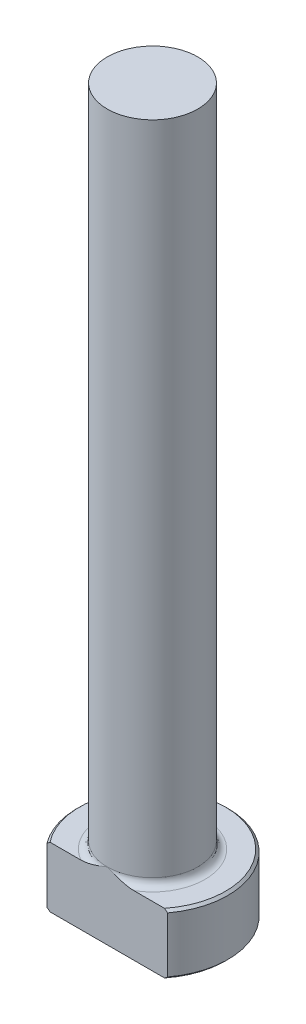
ISO-10303-21;
HEADER;
FILE_DESCRIPTION(('STEP AP214'),'2;1');
FILE_NAME('part.step','',(''),(''),'','','');
FILE_SCHEMA(('AUTOMOTIVE_DESIGN { 1 0 10303 214 1 1 1 1 }'));
ENDSEC;
DATA;
#1=APPLICATION_CONTEXT('core data for automotive mechanical design processes');
#2=APPLICATION_PROTOCOL_DEFINITION('international standard','automotive_design',2000,#1);
#3=PRODUCT_CONTEXT('',#1,'mechanical');
#4=PRODUCT('Part','Part','',(#3));
#5=PRODUCT_RELATED_PRODUCT_CATEGORY('part','',(#4));
#6=PRODUCT_DEFINITION_FORMATION('','',#4);
#7=PRODUCT_DEFINITION_CONTEXT('part definition',#1,'design');
#8=PRODUCT_DEFINITION('design','',#6,#7);
#9=PRODUCT_DEFINITION_SHAPE('','',#8);
#10=(LENGTH_UNIT() NAMED_UNIT(*) SI_UNIT(.MILLI.,.METRE.));
#11=(NAMED_UNIT(*) PLANE_ANGLE_UNIT() SI_UNIT($,.RADIAN.));
#12=(NAMED_UNIT(*) SI_UNIT($,.STERADIAN.) SOLID_ANGLE_UNIT());
#13=UNCERTAINTY_MEASURE_WITH_UNIT(LENGTH_MEASURE(1.E-05),#10,'distance_accuracy_value','');
#14=(GEOMETRIC_REPRESENTATION_CONTEXT(3) GLOBAL_UNCERTAINTY_ASSIGNED_CONTEXT((#13)) GLOBAL_UNIT_ASSIGNED_CONTEXT((#10,
#11,#12)) REPRESENTATION_CONTEXT('',''));
#15=CARTESIAN_POINT('',(0.,0.,0.));
#16=DIRECTION('',(0.,0.,1.));
#17=DIRECTION('',(1.,0.,0.));
#18=AXIS2_PLACEMENT_3D('',#15,#16,#17);
#19=CARTESIAN_POINT('',(0.,0.,0.));
#20=DIRECTION('',(0.,-1.,0.));
#21=DIRECTION('',(0.,0.,-1.));
#22=AXIS2_PLACEMENT_3D('',#19,#20,#21);
#23=PLANE('',#22);
#24=CARTESIAN_POINT('',(0.,0.,0.));
#25=DIRECTION('',(0.,-1.,0.));
#26=DIRECTION('',(0.,0.,-1.));
#27=AXIS2_PLACEMENT_3D('',#24,#25,#26);
#28=CIRCLE('',#27,7.68349999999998);
#29=CARTESIAN_POINT('',(-6.02949135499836,0.,4.76249999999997));
#30=VERTEX_POINT('',#29);
#31=CARTESIAN_POINT('',(6.02949135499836,0.,4.76249999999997));
#32=VERTEX_POINT('',#31);
#33=EDGE_CURVE('E98',#30,#32,#28,.T.);
#34=ORIENTED_EDGE('',*,*,#33,.T.);
#35=DIRECTION('',(-1.,0.,0.));
#36=VECTOR('',#35,1.);
#37=CARTESIAN_POINT('',(-6.34999999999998,0.,4.76249999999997));
#38=LINE('',#37,#36);
#39=EDGE_CURVE('E83',#32,#30,#38,.T.);
#40=ORIENTED_EDGE('',*,*,#39,.T.);
#41=EDGE_LOOP('',(#34,#40));
#42=FACE_BOUND('',#41,.T.);
#43=ADVANCED_FACE('F32',(#42),#23,.T.);
#44=CARTESIAN_POINT('',(0.,259.958771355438,0.));
#45=DIRECTION('',(0.,1.,0.));
#46=DIRECTION('',(0.,0.,1.));
#47=AXIS2_PLACEMENT_3D('',#44,#45,#46);
#48=CYLINDRICAL_SURFACE('',#47,7.93749999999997);
#49=CARTESIAN_POINT('',(0.,6.09600000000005,0.));
#50=DIRECTION('',(0.,1.,0.));
#51=DIRECTION('',(0.,0.,1.));
#52=AXIS2_PLACEMENT_3D('',#49,#50,#51);
#53=CIRCLE('',#52,7.93749999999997);
#54=CARTESIAN_POINT('',(-6.34999999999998,6.09600000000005,4.76249999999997));
#55=VERTEX_POINT('',#54);
#56=CARTESIAN_POINT('',(6.34999999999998,6.09600000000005,4.76249999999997));
#57=VERTEX_POINT('',#56);
#58=EDGE_CURVE('E104',#55,#57,#53,.F.);
#59=ORIENTED_EDGE('',*,*,#58,.T.);
#60=DIRECTION('',(0.,-1.,0.));
#61=VECTOR('',#60,1.);
#62=CARTESIAN_POINT('',(6.34999999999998,76.2,4.76249999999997));
#63=LINE('',#62,#61);
#64=CARTESIAN_POINT('',(6.34999999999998,0.253999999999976,4.76249999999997));
#65=VERTEX_POINT('',#64);
#66=EDGE_CURVE('E183',#57,#65,#63,.T.);
#67=ORIENTED_EDGE('',*,*,#66,.T.);
#68=CARTESIAN_POINT('',(0.,0.253999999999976,0.));
#69=DIRECTION('',(0.,-1.,0.));
#70=DIRECTION('',(0.,0.,-1.));
#71=AXIS2_PLACEMENT_3D('',#68,#69,#70);
#72=CIRCLE('',#71,7.93749999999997);
#73=CARTESIAN_POINT('',(-6.34999999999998,0.253999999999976,4.76249999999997));
#74=VERTEX_POINT('',#73);
#75=EDGE_CURVE('E100',#65,#74,#72,.F.);
#76=ORIENTED_EDGE('',*,*,#75,.T.);
#77=DIRECTION('',(0.,-1.,0.));
#78=VECTOR('',#77,1.);
#79=CARTESIAN_POINT('',(-6.34999999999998,76.2,4.76249999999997));
#80=LINE('',#79,#78);
#81=EDGE_CURVE('E93',#55,#74,#80,.T.);
#82=ORIENTED_EDGE('',*,*,#81,.F.);
#83=EDGE_LOOP('',(#59,#67,#76,#82));
#84=FACE_BOUND('',#83,.T.);
#85=ADVANCED_FACE('F158',(#84),#48,.T.);
#86=CARTESIAN_POINT('',(-7.93749999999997,6.35,0.));
#87=DIRECTION('',(0.,1.,0.));
#88=DIRECTION('',(0.,0.,1.));
#89=AXIS2_PLACEMENT_3D('',#86,#87,#88);
#90=PLANE('',#89);
#91=CARTESIAN_POINT('',(0.,6.35,0.));
#92=DIRECTION('',(0.,1.,0.));
#93=DIRECTION('',(0.,0.,1.));
#94=AXIS2_PLACEMENT_3D('',#91,#92,#93);
#95=CIRCLE('',#94,7.68350000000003);
#96=CARTESIAN_POINT('',(6.02949135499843,6.35,4.76249999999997));
#97=VERTEX_POINT('',#96);
#98=CARTESIAN_POINT('',(-6.02949135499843,6.35,4.76249999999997));
#99=VERTEX_POINT('',#98);
#100=EDGE_CURVE('E178',#97,#99,#95,.T.);
#101=ORIENTED_EDGE('',*,*,#100,.T.);
#102=DIRECTION('',(1.,0.,0.));
#103=VECTOR('',#102,1.);
#104=CARTESIAN_POINT('',(-7.93749999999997,6.35,4.76249999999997));
#105=LINE('',#104,#103);
#106=CARTESIAN_POINT('',(-2.79976677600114,6.35000000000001,4.76249999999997));
#107=VERTEX_POINT('',#106);
#108=EDGE_CURVE('E57',#99,#107,#105,.T.);
#109=ORIENTED_EDGE('',*,*,#108,.T.);
#110=CARTESIAN_POINT('',(0.,6.35,0.));
#111=DIRECTION('',(0.,1.,0.));
#112=DIRECTION('',(0.,0.,1.));
#113=AXIS2_PLACEMENT_3D('',#110,#111,#112);
#114=CIRCLE('',#113,5.52449999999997);
#115=CARTESIAN_POINT('',(2.79976677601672,6.35000000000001,4.76249999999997));
#116=VERTEX_POINT('',#115);
#117=EDGE_CURVE('E107',#107,#116,#114,.F.);
#118=ORIENTED_EDGE('',*,*,#117,.T.);
#119=EDGE_CURVE('E136',#116,#97,#105,.T.);
#120=ORIENTED_EDGE('',*,*,#119,.T.);
#121=EDGE_LOOP('',(#101,#109,#118,#120));
#122=FACE_BOUND('',#121,.T.);
#123=ADVANCED_FACE('F147',(#122),#90,.T.);
#124=CARTESIAN_POINT('',(0.,6.35000000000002,0.));
#125=DIRECTION('',(0.,-1.,0.));
#126=DIRECTION('',(0.,0.,-1.));
#127=AXIS2_PLACEMENT_3D('',#124,#125,#126);
#128=CONICAL_SURFACE('',#127,7.68350000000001,0.785398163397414);
#129=ORIENTED_EDGE('',*,*,#58,.F.);
#130=CARTESIAN_POINT('',(-13.9717238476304,-0.727613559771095,4.76249999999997));
#131=CARTESIAN_POINT('',(-13.7440124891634,-0.512084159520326,4.76249999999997));
#132=CARTESIAN_POINT('',(-13.5160318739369,-0.296838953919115,4.76249999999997));
#133=CARTESIAN_POINT('',(-13.0594385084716,0.132982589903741,4.76249999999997));
#134=CARTESIAN_POINT('',(-12.8308257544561,0.347558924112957,4.76249999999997));
#135=CARTESIAN_POINT('',(-12.1433698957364,0.990628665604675,4.76249999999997));
#136=CARTESIAN_POINT('',(-11.683438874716,1.41796058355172,4.76249999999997));
#137=CARTESIAN_POINT('',(-10.7398192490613,2.28660831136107,4.76249999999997));
#138=CARTESIAN_POINT('',(-10.2559580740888,2.72773732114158,4.76249999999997));
#139=CARTESIAN_POINT('',(-9.52579613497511,3.3840413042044,4.76249999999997));
#140=CARTESIAN_POINT('',(-9.28181372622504,3.60179461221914,4.76249999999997));
#141=CARTESIAN_POINT('',(-8.79195583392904,4.03515959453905,4.76249999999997));
#142=CARTESIAN_POINT('',(-8.54608036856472,4.25077128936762,4.76249999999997));
#143=CARTESIAN_POINT('',(-8.0523506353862,4.67899963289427,4.76249999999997));
#144=CARTESIAN_POINT('',(-7.80449972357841,4.89162014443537,4.76249999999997));
#145=CARTESIAN_POINT('',(-7.30587283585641,5.31343752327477,4.76249999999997));
#146=CARTESIAN_POINT('',(-7.05509670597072,5.52263420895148,4.76249999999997));
#147=CARTESIAN_POINT('',(-6.54895570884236,5.9372628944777,4.76249999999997));
#148=CARTESIAN_POINT('',(-6.29357776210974,6.14267898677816,4.76249999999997));
#149=CARTESIAN_POINT('',(-5.77806261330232,6.54738613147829,4.76249999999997));
#150=CARTESIAN_POINT('',(-5.51792616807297,6.7466781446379,4.76249999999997));
#151=CARTESIAN_POINT('',(-4.99669315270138,7.13290361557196,4.76249999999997));
#152=CARTESIAN_POINT('',(-4.73572280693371,7.32000565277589,4.76249999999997));
#153=CARTESIAN_POINT('',(-4.33820944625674,7.59205599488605,4.76249999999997));
#154=CARTESIAN_POINT('',(-4.2046360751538,7.68134253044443,4.76249999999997));
#155=CARTESIAN_POINT('',(-3.93520014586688,7.85638938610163,4.76249999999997));
#156=CARTESIAN_POINT('',(-3.79933771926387,7.94214990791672,4.76249999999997));
#157=CARTESIAN_POINT('',(-3.52582078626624,8.10887856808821,4.76249999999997));
#158=CARTESIAN_POINT('',(-3.38818211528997,8.18987258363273,4.76249999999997));
#159=CARTESIAN_POINT('',(-3.10994368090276,8.34667799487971,4.76249999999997));
#160=CARTESIAN_POINT('',(-2.96934354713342,8.42248873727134,4.76249999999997));
#161=CARTESIAN_POINT('',(-2.68509318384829,8.5675857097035,4.76249999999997));
#162=CARTESIAN_POINT('',(-2.54144841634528,8.63688258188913,4.76249999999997));
#163=CARTESIAN_POINT('',(-2.25062082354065,8.76758710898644,4.76249999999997));
#164=CARTESIAN_POINT('',(-2.10343915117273,8.8289972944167,4.76249999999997));
#165=CARTESIAN_POINT('',(-1.88433335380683,8.91218004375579,4.76249999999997));
#166=CARTESIAN_POINT('',(-1.81383186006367,8.93772120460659,4.76249999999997));
#167=CARTESIAN_POINT('',(-1.67202052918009,8.98645907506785,4.76249999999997));
#168=CARTESIAN_POINT('',(-1.6007106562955,9.00965568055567,4.76249999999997));
#169=CARTESIAN_POINT('',(-1.38555472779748,9.07542289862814,4.76249999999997));
#170=CARTESIAN_POINT('',(-1.24050522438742,9.11416209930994,4.76249999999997));
#171=CARTESIAN_POINT('',(-0.948515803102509,9.17953563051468,4.76249999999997));
#172=CARTESIAN_POINT('',(-0.801590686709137,9.20623542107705,4.76249999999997));
#173=CARTESIAN_POINT('',(-0.505930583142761,9.24644001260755,4.76249999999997));
#174=CARTESIAN_POINT('',(-0.3571958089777,9.25994635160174,4.76249999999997));
#175=CARTESIAN_POINT('',(-0.0580773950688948,9.27300540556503,4.76249999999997));
#176=CARTESIAN_POINT('',(0.0923105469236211,9.27246142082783,4.76249999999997));
#177=CARTESIAN_POINT('',(0.392354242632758,9.25721584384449,4.76249999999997));
#178=CARTESIAN_POINT('',(0.542009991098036,9.24251415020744,4.76249999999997));
#179=CARTESIAN_POINT('',(0.840076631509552,9.19973713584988,4.76249999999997));
#180=CARTESIAN_POINT('',(0.988478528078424,9.17160009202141,4.76249999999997));
#181=CARTESIAN_POINT('',(1.28250292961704,9.1034143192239,4.76249999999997));
#182=CARTESIAN_POINT('',(1.42812484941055,9.06336311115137,4.76249999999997));
#183=CARTESIAN_POINT('',(1.80157652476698,8.94630142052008,4.76249999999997));
#184=CARTESIAN_POINT('',(2.02694427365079,8.86145845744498,4.76249999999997));
#185=CARTESIAN_POINT('',(2.46947102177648,8.67257542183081,4.76249999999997));
#186=CARTESIAN_POINT('',(2.6866230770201,8.56851952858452,4.76249999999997));
#187=CARTESIAN_POINT('',(3.00782565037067,8.40144847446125,4.76249999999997));
#188=CARTESIAN_POINT('',(3.11463323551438,8.34362692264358,4.76249999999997));
#189=CARTESIAN_POINT('',(3.32653927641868,8.22492412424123,4.76249999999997));
#190=CARTESIAN_POINT('',(3.43163771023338,8.16404283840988,4.76249999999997));
#191=CARTESIAN_POINT('',(3.64022442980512,8.03970047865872,4.76249999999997));
#192=CARTESIAN_POINT('',(3.7437134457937,7.97624062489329,4.76249999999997));
#193=CARTESIAN_POINT('',(3.94927417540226,7.84708004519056,4.76249999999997));
#194=CARTESIAN_POINT('',(4.05134594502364,7.78137940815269,4.76249999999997));
#195=CARTESIAN_POINT('',(4.39010681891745,7.55875403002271,4.76249999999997));
#196=CARTESIAN_POINT('',(4.62396840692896,7.39752115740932,4.76249999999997));
#197=CARTESIAN_POINT('',(5.08629215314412,7.06746483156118,4.76249999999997));
#198=CARTESIAN_POINT('',(5.31475310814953,6.89863971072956,4.76249999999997));
#199=CARTESIAN_POINT('',(5.76756292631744,6.55523763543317,4.76249999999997));
#200=CARTESIAN_POINT('',(5.9919086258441,6.38065652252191,4.76249999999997));
#201=CARTESIAN_POINT('',(6.43717517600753,6.02723273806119,4.76249999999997));
#202=CARTESIAN_POINT('',(6.65809630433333,5.84839041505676,4.76249999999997));
#203=CARTESIAN_POINT('',(7.0979064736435,5.48680641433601,4.76249999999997));
#204=CARTESIAN_POINT('',(7.31678672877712,5.30405407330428,4.76249999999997));
#205=CARTESIAN_POINT('',(7.75231370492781,4.93590430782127,4.76249999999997));
#206=CARTESIAN_POINT('',(7.96896038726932,4.75050683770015,4.76249999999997));
#207=CARTESIAN_POINT('',(8.40032527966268,4.37766695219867,4.76249999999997));
#208=CARTESIAN_POINT('',(8.615044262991,4.19022543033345,4.76249999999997));
#209=CARTESIAN_POINT('',(9.04295707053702,3.81360841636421,4.76249999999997));
#210=CARTESIAN_POINT('',(9.25615088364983,3.62443291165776,4.76249999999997));
#211=CARTESIAN_POINT('',(9.85099823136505,3.09302727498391,4.76249999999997));
#212=CARTESIAN_POINT('',(10.2312296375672,2.74920552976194,4.76249999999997));
#213=CARTESIAN_POINT('',(10.988675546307,2.05817278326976,4.76249999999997));
#214=CARTESIAN_POINT('',(11.3658896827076,1.71096138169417,4.76249999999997));
#215=CARTESIAN_POINT('',(12.115583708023,1.01624347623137,4.76249999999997));
#216=CARTESIAN_POINT('',(12.4880784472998,0.66875297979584,4.76249999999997));
#217=CARTESIAN_POINT('',(13.2311819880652,-0.0281268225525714,4.76249999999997));
#218=CARTESIAN_POINT('',(13.6017910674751,-0.377515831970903,4.76249999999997));
#219=CARTESIAN_POINT('',(13.9717238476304,-0.727613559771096,4.76249999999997));
#220=B_SPLINE_CURVE_WITH_KNOTS('',3,(#130,#131,#132,#133,#134,#135,#136,#137,#138,#139,#140,
#141,#142,#143,#144,#145,#146,#147,#148,#149,#150,#151,#152,#153,#154,#155,#156,#157,#158,#159,
#160,#161,#162,#163,#164,#165,#166,#167,#168,#169,#170,#171,#172,#173,#174,#175,#176,#177,#178,
#179,#180,#181,#182,#183,#184,#185,#186,#187,#188,#189,#190,#191,#192,#193,#194,#195,#196,#197,
#198,#199,#200,#201,#202,#203,#204,#205,#206,#207,#208,#209,#210,#211,#212,#213,#214,#215,#216,
#217,#218,#219),.UNSPECIFIED.,.F.,.F.,(4,2,2,2,2,2,2,2,2,2,2,2,2,2,2,2,2,2,2,2,2,2,2,2,2,2,2,2,
2,2,2,2,2,2,2,2,2,2,2,2,2,2,2,2,4),(0.,0.940610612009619,1.88122685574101,3.76464908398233,
5.72889030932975,6.70994924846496,7.69099877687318,8.67063680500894,9.65032663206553,
10.6334769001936,11.6164721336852,12.5795523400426,13.0615108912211,13.5434418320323,
14.0224542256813,14.5015268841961,14.9798027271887,15.4579247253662,15.6828447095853,
15.9077746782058,16.3577079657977,16.8051644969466,17.2525688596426,17.7030532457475,
18.1535408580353,18.6061182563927,19.0587898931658,19.7799130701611,20.5016327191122,
20.8659558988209,21.2302837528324,21.5944411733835,21.9585841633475,22.8105074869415,
23.6626188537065,24.5153599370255,25.3680315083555,26.2234368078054,27.0788568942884,
27.9339169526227,28.7889832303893,30.3268416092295,31.8648838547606,33.3931161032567,
34.921116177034),.UNSPECIFIED.);
#221=EDGE_CURVE('E135',#55,#99,#220,.T.);
#222=ORIENTED_EDGE('',*,*,#221,.T.);
#223=ORIENTED_EDGE('',*,*,#100,.F.);
#224=EDGE_CURVE('E127',#97,#57,#220,.T.);
#225=ORIENTED_EDGE('',*,*,#224,.T.);
#226=EDGE_LOOP('',(#129,#222,#223,#225));
#227=FACE_BOUND('',#226,.T.);
#228=ADVANCED_FACE('F143',(#227),#128,.T.);
#229=CARTESIAN_POINT('',(0.,0.253999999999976,0.));
#230=DIRECTION('',(0.,1.,0.));
#231=DIRECTION('',(0.,0.,1.));
#232=AXIS2_PLACEMENT_3D('',#229,#230,#231);
#233=CONICAL_SURFACE('',#232,7.93749999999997,0.785398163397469);
#234=ORIENTED_EDGE('',*,*,#75,.F.);
#235=CARTESIAN_POINT('',(13.9717238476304,7.07761355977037,4.76249999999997));
#236=CARTESIAN_POINT('',(13.7440124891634,6.86208415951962,4.76249999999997));
#237=CARTESIAN_POINT('',(13.5160318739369,6.64683895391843,4.76249999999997));
#238=CARTESIAN_POINT('',(13.0594385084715,6.21701741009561,4.76249999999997));
#239=CARTESIAN_POINT('',(12.8308257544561,6.00244107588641,4.76249999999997));
#240=CARTESIAN_POINT('',(12.1433698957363,5.35937133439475,4.76249999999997));
#241=CARTESIAN_POINT('',(11.683438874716,4.93203941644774,4.76249999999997));
#242=CARTESIAN_POINT('',(10.7398192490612,4.06339168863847,4.76249999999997));
#243=CARTESIAN_POINT('',(10.2559580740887,3.62226267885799,4.76249999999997));
#244=CARTESIAN_POINT('',(9.525796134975,2.96595869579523,4.76249999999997));
#245=CARTESIAN_POINT('',(9.28181372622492,2.74820538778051,4.76249999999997));
#246=CARTESIAN_POINT('',(8.79195583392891,2.31484040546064,4.76249999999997));
#247=CARTESIAN_POINT('',(8.54608036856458,2.09922871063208,4.76249999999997));
#248=CARTESIAN_POINT('',(8.05235063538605,1.67100036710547,4.76249999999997));
#249=CARTESIAN_POINT('',(7.80449972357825,1.45837985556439,4.76249999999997));
#250=CARTESIAN_POINT('',(7.30587283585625,1.03656247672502,4.76249999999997));
#251=CARTESIAN_POINT('',(7.05509670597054,0.827365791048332,4.76249999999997));
#252=CARTESIAN_POINT('',(6.54895570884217,0.412737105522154,4.76249999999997));
#253=CARTESIAN_POINT('',(6.29357776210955,0.207321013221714,4.76249999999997));
#254=CARTESIAN_POINT('',(5.77806261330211,-0.197386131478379,4.76249999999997));
#255=CARTESIAN_POINT('',(5.51792616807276,-0.396678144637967,4.76249999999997));
#256=CARTESIAN_POINT('',(4.99669315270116,-0.782903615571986,4.76249999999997));
#257=CARTESIAN_POINT('',(4.73572280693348,-0.970005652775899,4.76249999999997));
#258=CARTESIAN_POINT('',(4.33820944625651,-1.24205599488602,4.76249999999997));
#259=CARTESIAN_POINT('',(4.20463607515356,-1.33134253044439,4.76249999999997));
#260=CARTESIAN_POINT('',(3.93520014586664,-1.50638938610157,4.76249999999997));
#261=CARTESIAN_POINT('',(3.79933771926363,-1.59214990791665,4.76249999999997));
#262=CARTESIAN_POINT('',(3.525820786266,-1.75887856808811,4.76249999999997));
#263=CARTESIAN_POINT('',(3.38818211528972,-1.83987258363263,4.76249999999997));
#264=CARTESIAN_POINT('',(3.1099436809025,-1.99667799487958,4.76249999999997));
#265=CARTESIAN_POINT('',(2.96934354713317,-2.07248873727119,4.76249999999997));
#266=CARTESIAN_POINT('',(2.68509318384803,-2.21758570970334,4.76249999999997));
#267=CARTESIAN_POINT('',(2.54144841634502,-2.28688258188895,4.76249999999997));
#268=CARTESIAN_POINT('',(2.25062082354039,-2.41758710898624,4.76249999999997));
#269=CARTESIAN_POINT('',(2.10343915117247,-2.47899729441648,4.76249999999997));
#270=CARTESIAN_POINT('',(1.88433335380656,-2.56218004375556,4.76249999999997));
#271=CARTESIAN_POINT('',(1.81383186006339,-2.58772120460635,4.76249999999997));
#272=CARTESIAN_POINT('',(1.6720205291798,-2.63645907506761,4.76249999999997));
#273=CARTESIAN_POINT('',(1.60071065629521,-2.65965568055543,4.76249999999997));
#274=CARTESIAN_POINT('',(1.38555472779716,-2.72542289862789,4.76249999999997));
#275=CARTESIAN_POINT('',(1.24050522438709,-2.76416209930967,4.76249999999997));
#276=CARTESIAN_POINT('',(0.94851580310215,-2.82953563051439,4.76249999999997));
#277=CARTESIAN_POINT('',(0.801590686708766,-2.85623542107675,4.76249999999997));
#278=CARTESIAN_POINT('',(0.505930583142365,-2.89644001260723,4.76249999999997));
#279=CARTESIAN_POINT('',(0.357195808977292,-2.9099463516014,4.76249999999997));
#280=CARTESIAN_POINT('',(0.0580773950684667,-2.92300540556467,4.76249999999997));
#281=CARTESIAN_POINT('',(-0.0923105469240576,-2.92246142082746,4.76249999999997));
#282=CARTESIAN_POINT('',(-0.392354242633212,-2.90721584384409,4.76249999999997));
#283=CARTESIAN_POINT('',(-0.5420099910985,-2.89251415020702,4.76249999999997));
#284=CARTESIAN_POINT('',(-0.840076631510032,-2.84973713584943,4.76249999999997));
#285=CARTESIAN_POINT('',(-0.988478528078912,-2.82160009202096,4.76249999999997));
#286=CARTESIAN_POINT('',(-1.28250292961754,-2.75341431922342,4.76249999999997));
#287=CARTESIAN_POINT('',(-1.42812484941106,-2.71336311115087,4.76249999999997));
#288=CARTESIAN_POINT('',(-1.80157652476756,-2.59630142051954,4.76249999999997));
#289=CARTESIAN_POINT('',(-2.02694427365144,-2.5114584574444,4.76249999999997));
#290=CARTESIAN_POINT('',(-2.46947102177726,-2.32257542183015,4.76249999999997));
#291=CARTESIAN_POINT('',(-2.68662307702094,-2.21851952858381,4.76249999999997));
#292=CARTESIAN_POINT('',(-3.0078256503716,-2.05144847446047,4.76249999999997));
#293=CARTESIAN_POINT('',(-3.11463323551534,-1.99362692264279,4.76249999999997));
#294=CARTESIAN_POINT('',(-3.3265392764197,-1.87492412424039,4.76249999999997));
#295=CARTESIAN_POINT('',(-3.43163771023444,-1.81404283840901,4.76249999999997));
#296=CARTESIAN_POINT('',(-3.64022442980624,-1.68970047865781,4.76249999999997));
#297=CARTESIAN_POINT('',(-3.74371344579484,-1.62624062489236,4.76249999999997));
#298=CARTESIAN_POINT('',(-3.94927417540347,-1.49708004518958,4.76249999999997));
#299=CARTESIAN_POINT('',(-4.05134594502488,-1.43137940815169,4.76249999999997));
#300=CARTESIAN_POINT('',(-4.39010681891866,-1.2087540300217,4.76249999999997));
#301=CARTESIAN_POINT('',(-4.62396840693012,-1.04752115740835,4.76249999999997));
#302=CARTESIAN_POINT('',(-5.08629215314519,-0.71746483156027,4.76249999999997));
#303=CARTESIAN_POINT('',(-5.31475310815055,-0.548639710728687,4.76249999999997));
#304=CARTESIAN_POINT('',(-5.76756292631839,-0.205237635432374,4.76249999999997));
#305=CARTESIAN_POINT('',(-5.991908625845,-0.03065652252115,4.76249999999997));
#306=CARTESIAN_POINT('',(-6.43717517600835,0.322767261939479,4.76249999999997));
#307=CARTESIAN_POINT('',(-6.65809630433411,0.50160958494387,4.76249999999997));
#308=CARTESIAN_POINT('',(-7.0979064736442,0.863193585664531,4.76249999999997));
#309=CARTESIAN_POINT('',(-7.31678672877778,1.04594592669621,4.76249999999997));
#310=CARTESIAN_POINT('',(-7.7523137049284,1.41409569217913,4.76249999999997));
#311=CARTESIAN_POINT('',(-7.96896038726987,1.5994931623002,4.76249999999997));
#312=CARTESIAN_POINT('',(-8.40032527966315,1.97233304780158,4.76249999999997));
#313=CARTESIAN_POINT('',(-8.61504426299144,2.15977456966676,4.76249999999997));
#314=CARTESIAN_POINT('',(-9.04295707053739,2.5363915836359,4.76249999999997));
#315=CARTESIAN_POINT('',(-9.25615088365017,2.72556708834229,4.76249999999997));
#316=CARTESIAN_POINT('',(-9.85099823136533,3.25697272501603,4.76249999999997));
#317=CARTESIAN_POINT('',(-10.2312296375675,3.60079447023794,4.76249999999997));
#318=CARTESIAN_POINT('',(-10.9886755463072,4.29182721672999,4.76249999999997));
#319=CARTESIAN_POINT('',(-11.3658896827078,4.63903861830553,4.76249999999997));
#320=CARTESIAN_POINT('',(-12.1155837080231,5.3337565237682,4.76249999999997));
#321=CARTESIAN_POINT('',(-12.4880784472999,5.68124702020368,4.76249999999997));
#322=CARTESIAN_POINT('',(-13.2311819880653,6.37812682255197,4.76249999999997));
#323=CARTESIAN_POINT('',(-13.6017910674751,6.72751583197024,4.76249999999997));
#324=CARTESIAN_POINT('',(-13.9717238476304,7.07761355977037,4.76249999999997));
#325=B_SPLINE_CURVE_WITH_KNOTS('',3,(#235,#236,#237,#238,#239,#240,#241,#242,#243,#244,#245,
#246,#247,#248,#249,#250,#251,#252,#253,#254,#255,#256,#257,#258,#259,#260,#261,#262,#263,#264,
#265,#266,#267,#268,#269,#270,#271,#272,#273,#274,#275,#276,#277,#278,#279,#280,#281,#282,#283,
#284,#285,#286,#287,#288,#289,#290,#291,#292,#293,#294,#295,#296,#297,#298,#299,#300,#301,#302,
#303,#304,#305,#306,#307,#308,#309,#310,#311,#312,#313,#314,#315,#316,#317,#318,#319,#320,#321,
#322,#323,#324),.UNSPECIFIED.,.F.,.F.,(4,2,2,2,2,2,2,2,2,2,2,2,2,2,2,2,2,2,2,2,2,2,2,2,2,2,2,2,
2,2,2,2,2,2,2,2,2,2,2,2,2,2,2,2,4),(0.,0.940610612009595,1.88122685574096,3.76464908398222,
5.7288903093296,6.70994924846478,7.69099877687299,8.67063680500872,9.65032663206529,
10.6334769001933,11.6164721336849,12.5795523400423,13.0615108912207,13.543441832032,
14.022454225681,14.5015268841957,14.9798027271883,15.4579247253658,15.682844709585,
15.9077746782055,16.3577079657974,16.8051644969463,17.2525688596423,17.7030532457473,
18.1535408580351,18.6061182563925,19.0587898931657,19.7799130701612,20.5016327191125,
20.8659558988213,21.2302837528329,21.5944411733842,21.9585841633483,22.8105074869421,
23.6626188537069,24.5153599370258,25.3680315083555,26.2234368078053,27.0788568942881,
27.9339169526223,28.7889832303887,30.3268416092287,31.8648838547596,33.3931161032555,
34.9211161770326),.UNSPECIFIED.);
#326=EDGE_CURVE('E86',#65,#32,#325,.T.);
#327=ORIENTED_EDGE('',*,*,#326,.T.);
#328=ORIENTED_EDGE('',*,*,#33,.F.);
#329=EDGE_CURVE('E89',#30,#74,#325,.T.);
#330=ORIENTED_EDGE('',*,*,#329,.T.);
#331=EDGE_LOOP('',(#234,#327,#328,#330));
#332=FACE_BOUND('',#331,.T.);
#333=ADVANCED_FACE('F97',(#332),#233,.T.);
#334=CARTESIAN_POINT('',(0.,7.11200000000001,0.));
#335=DIRECTION('',(0.,1.,0.));
#336=DIRECTION('',(0.,0.,1.));
#337=AXIS2_PLACEMENT_3D('',#334,#335,#336);
#338=TOROIDAL_SURFACE('',#337,5.52449999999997,0.762);
#339=CARTESIAN_POINT('',(0.,7.11200000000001,4.76249999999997));
#340=CARTESIAN_POINT('',(1.7571576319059E-10,7.11200099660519,4.76249999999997));
#341=CARTESIAN_POINT('',(2.11716127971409E-07,7.11200199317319,4.76249999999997));
#342=CARTESIAN_POINT('',(8.80753956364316E-07,7.1120039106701,4.76249999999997));
#343=CARTESIAN_POINT('',(1.34491796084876E-06,7.11200482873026,4.76249999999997));
#344=CARTESIAN_POINT('',(2.45982947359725E-06,7.11200666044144,4.76249999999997));
#345=CARTESIAN_POINT('',(3.12384157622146E-06,7.11200756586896,4.76249999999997));
#346=CARTESIAN_POINT('',(4.5550794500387E-06,7.11200927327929,4.76249999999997));
#347=CARTESIAN_POINT('',(5.32136303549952E-06,7.11201007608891,4.76249999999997));
#348=CARTESIAN_POINT('',(8.07192927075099E-06,7.11201277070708,4.76249999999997));
#349=CARTESIAN_POINT('',(1.01901643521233E-05,7.11201452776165,4.76249999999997));
#350=CARTESIAN_POINT('',(1.4565159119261E-05,7.11201765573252,4.76249999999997));
#351=CARTESIAN_POINT('',(1.68139275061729E-05,7.11201903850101,4.76249999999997));
#352=CARTESIAN_POINT('',(2.56002968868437E-05,7.1120242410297,4.76249999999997));
#353=CARTESIAN_POINT('',(3.23057719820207E-05,7.11202779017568,4.76249999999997));
#354=CARTESIAN_POINT('',(4.55210144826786E-05,7.11203358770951,4.76249999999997));
#355=CARTESIAN_POINT('',(5.19929180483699E-05,7.1120359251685,4.76249999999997));
#356=CARTESIAN_POINT('',(7.95921607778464E-05,7.11204586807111,4.76249999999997));
#357=CARTESIAN_POINT('',(0.000100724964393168,7.11205341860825,4.76249999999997));
#358=CARTESIAN_POINT('',(0.00014026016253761,7.11206552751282,4.76249999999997));
#359=CARTESIAN_POINT('',(0.000158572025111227,7.11207036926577,4.76249999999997));
#360=CARTESIAN_POINT('',(0.000291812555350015,7.11210874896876,4.76249999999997));
#361=CARTESIAN_POINT('',(0.000401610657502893,7.11215771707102,4.76249999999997));
#362=CARTESIAN_POINT('',(0.0008287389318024,7.1123412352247,4.76249999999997));
#363=CARTESIAN_POINT('',(0.00114963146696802,7.11246431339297,4.76249999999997));
#364=CARTESIAN_POINT('',(0.00239628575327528,7.11294956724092,4.76249999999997));
#365=CARTESIAN_POINT('',(0.00331839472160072,7.11332376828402,4.76249999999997));
#366=CARTESIAN_POINT('',(0.00709602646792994,7.11484953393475,4.76249999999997));
#367=CARTESIAN_POINT('',(0.00995556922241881,7.11598757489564,4.76249999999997));
#368=CARTESIAN_POINT('',(0.0776380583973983,7.14293320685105,4.76249999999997));
#369=CARTESIAN_POINT('',(0.142407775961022,7.16892226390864,4.76249999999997));
#370=CARTESIAN_POINT('',(0.269647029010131,7.2196189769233,4.76249999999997));
#371=CARTESIAN_POINT('',(0.332112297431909,7.24433828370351,4.76249999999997));
#372=CARTESIAN_POINT('',(0.464537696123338,7.29630170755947,4.76249999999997));
#373=CARTESIAN_POINT('',(0.534515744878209,7.32350106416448,4.76249999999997));
#374=CARTESIAN_POINT('',(0.67548014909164,7.3774238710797,4.76249999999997));
#375=CARTESIAN_POINT('',(0.746469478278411,7.40413956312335,4.76249999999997));
#376=CARTESIAN_POINT('',(0.870073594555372,7.44962494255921,4.76249999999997));
#377=CARTESIAN_POINT('',(0.922600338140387,7.46863321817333,4.76249999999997));
#378=CARTESIAN_POINT('',(1.02776923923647,7.50591527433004,4.76249999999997));
#379=CARTESIAN_POINT('',(1.08041080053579,7.52419073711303,4.76249999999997));
#380=CARTESIAN_POINT('',(1.23635883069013,7.5769919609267,4.76249999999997));
#381=CARTESIAN_POINT('',(1.34005657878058,7.61037532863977,4.76249999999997));
#382=CARTESIAN_POINT('',(1.56359060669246,7.67746997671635,4.76249999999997));
#383=CARTESIAN_POINT('',(1.68362015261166,7.71054957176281,4.76249999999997));
#384=CARTESIAN_POINT('',(1.92642555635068,7.76967498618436,4.76249999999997));
#385=CARTESIAN_POINT('',(2.04921557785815,7.79566353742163,4.76249999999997));
#386=CARTESIAN_POINT('',(2.30422797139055,7.83918726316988,4.76249999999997));
#387=CARTESIAN_POINT('',(2.43656426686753,7.85610069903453,4.76249999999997));
#388=CARTESIAN_POINT('',(2.63563546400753,7.8702758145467,4.76249999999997));
#389=CARTESIAN_POINT('',(2.70197039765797,7.87313972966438,4.76249999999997));
#390=CARTESIAN_POINT('',(2.83467605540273,7.87452977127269,4.76249999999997));
#391=CARTESIAN_POINT('',(2.90104677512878,7.87305634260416,4.76249999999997));
#392=CARTESIAN_POINT('',(3.06624711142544,7.86305254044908,4.76249999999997));
#393=CARTESIAN_POINT('',(3.1649502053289,7.85140164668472,4.76249999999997));
#394=CARTESIAN_POINT('',(3.3102514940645,7.82310986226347,4.76249999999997));
#395=CARTESIAN_POINT('',(3.35793795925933,7.81197880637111,4.76249999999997));
#396=CARTESIAN_POINT('',(3.45215770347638,7.78564548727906,4.76249999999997));
#397=CARTESIAN_POINT('',(3.49869187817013,7.77044650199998,4.76249999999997));
#398=CARTESIAN_POINT('',(3.59306902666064,7.73421407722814,4.76249999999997));
#399=CARTESIAN_POINT('',(3.64079022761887,7.71285751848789,4.76249999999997));
#400=CARTESIAN_POINT('',(3.73313951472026,7.66398014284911,4.76249999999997));
#401=CARTESIAN_POINT('',(3.77776331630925,7.63645100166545,4.76249999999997));
#402=CARTESIAN_POINT('',(3.8538778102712,7.58041326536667,4.76249999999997));
#403=CARTESIAN_POINT('',(3.88624519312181,7.55310714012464,4.76249999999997));
#404=CARTESIAN_POINT('',(3.94622799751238,7.49369496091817,4.76249999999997));
#405=CARTESIAN_POINT('',(3.97385320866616,7.46159905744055,4.76249999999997));
#406=CARTESIAN_POINT('',(4.01655184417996,7.4011650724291,4.76249999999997));
#407=CARTESIAN_POINT('',(4.03304226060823,7.37383278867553,4.76249999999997));
#408=CARTESIAN_POINT('',(4.06135260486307,7.31682811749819,4.76249999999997));
#409=CARTESIAN_POINT('',(4.07317539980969,7.28715718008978,4.76249999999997));
#410=CARTESIAN_POINT('',(4.09136459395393,7.22592510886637,4.76249999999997));
#411=CARTESIAN_POINT('',(4.09769076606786,7.19435181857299,4.76249999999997));
#412=CARTESIAN_POINT('',(4.10417375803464,7.13057793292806,4.76249999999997));
#413=CARTESIAN_POINT('',(4.10433369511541,7.0983776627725,4.76249999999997));
#414=CARTESIAN_POINT('',(4.09881588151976,7.03816798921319,4.76249999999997));
#415=CARTESIAN_POINT('',(4.09379438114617,7.01009545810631,4.76249999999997));
#416=CARTESIAN_POINT('',(4.07925766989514,6.95514890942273,4.76249999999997));
#417=CARTESIAN_POINT('',(4.06974176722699,6.92827507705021,4.76249999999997));
#418=CARTESIAN_POINT('',(4.04639465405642,6.87537805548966,4.76249999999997));
#419=CARTESIAN_POINT('',(4.03242569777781,6.84941634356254,4.76249999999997));
#420=CARTESIAN_POINT('',(4.00102190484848,6.79970293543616,4.76249999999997));
#421=CARTESIAN_POINT('',(3.98358563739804,6.77595215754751,4.76249999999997));
#422=CARTESIAN_POINT('',(3.93494606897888,6.71761387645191,4.76249999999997));
#423=CARTESIAN_POINT('',(3.90164076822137,6.68477550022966,4.76249999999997));
#424=CARTESIAN_POINT('',(3.83023707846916,6.62476083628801,4.76249999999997));
#425=CARTESIAN_POINT('',(3.79212391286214,6.59760272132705,4.76249999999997));
#426=CARTESIAN_POINT('',(3.69123876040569,6.53519525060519,4.76249999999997));
#427=CARTESIAN_POINT('',(3.62627547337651,6.5035096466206,4.76249999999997));
#428=CARTESIAN_POINT('',(3.49255240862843,6.45041788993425,4.76249999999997));
#429=CARTESIAN_POINT('',(3.42379589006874,6.42900306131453,4.76249999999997));
#430=CARTESIAN_POINT('',(3.29415895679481,6.39697273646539,4.76249999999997));
#431=CARTESIAN_POINT('',(3.23354049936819,6.38525800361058,4.76249999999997));
#432=CARTESIAN_POINT('',(3.11149484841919,6.36705546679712,4.76249999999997));
#433=CARTESIAN_POINT('',(3.05006701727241,6.36057206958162,4.76249999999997));
#434=CARTESIAN_POINT('',(2.92589148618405,6.35201311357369,4.76249999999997));
#435=CARTESIAN_POINT('',(2.86313887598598,6.35001297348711,4.76249999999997));
#436=CARTESIAN_POINT('',(2.73768820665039,6.34998716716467,4.76249999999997));
#437=CARTESIAN_POINT('',(2.67499013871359,6.35195889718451,4.76249999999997));
#438=CARTESIAN_POINT('',(2.52932457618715,6.3605299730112,4.76249999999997));
#439=CARTESIAN_POINT('',(2.44643477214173,6.36843196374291,4.76249999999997));
#440=CARTESIAN_POINT('',(2.28127175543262,6.38922870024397,4.76249999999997));
#441=CARTESIAN_POINT('',(2.19899884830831,6.40212577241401,4.76249999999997));
#442=CARTESIAN_POINT('',(1.95269348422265,6.44712458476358,4.76249999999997));
#443=CARTESIAN_POINT('',(1.78980549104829,6.48548332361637,4.76249999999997));
#444=CARTESIAN_POINT('',(1.48033682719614,6.56994207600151,4.76249999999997));
#445=CARTESIAN_POINT('',(1.33350347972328,6.615164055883,4.76249999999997));
#446=CARTESIAN_POINT('',(1.04345459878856,6.71161170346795,4.76249999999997));
#447=CARTESIAN_POINT('',(0.900217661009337,6.76277370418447,4.76249999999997));
#448=CARTESIAN_POINT('',(0.704750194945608,6.83559047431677,4.76249999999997));
#449=CARTESIAN_POINT('',(0.651886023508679,6.85558735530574,4.76249999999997));
#450=CARTESIAN_POINT('',(0.544940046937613,6.89652727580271,4.76249999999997));
#451=CARTESIAN_POINT('',(0.49086245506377,6.91748138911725,4.76249999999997));
#452=CARTESIAN_POINT('',(0.399545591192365,6.95317215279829,4.76249999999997));
#453=CARTESIAN_POINT('',(0.362273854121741,6.96782635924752,4.76249999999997));
#454=CARTESIAN_POINT('',(0.288146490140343,6.9971046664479,4.76249999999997));
#455=CARTESIAN_POINT('',(0.251290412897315,7.01172761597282,4.76249999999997));
#456=CARTESIAN_POINT('',(0.181451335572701,7.03949988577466,4.76249999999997));
#457=CARTESIAN_POINT('',(0.14846593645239,7.05264357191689,4.76249999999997));
#458=CARTESIAN_POINT('',(0.0812672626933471,7.07951218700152,4.76249999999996));
#459=CARTESIAN_POINT('',(0.0470550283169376,7.09324020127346,4.76249999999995));
#460=CARTESIAN_POINT('',(0.00995870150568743,7.10801136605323,4.76249999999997));
#461=CARTESIAN_POINT('',(0.00710220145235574,7.10914804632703,4.76249999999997));
#462=CARTESIAN_POINT('',(0.00332530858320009,7.11067346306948,4.76249999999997));
#463=CARTESIAN_POINT('',(0.00240087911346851,7.11104861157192,4.76249999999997));
#464=CARTESIAN_POINT('',(0.0011512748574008,7.11153501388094,4.76249999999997));
#465=CARTESIAN_POINT('',(0.000829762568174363,7.11165833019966,4.76249999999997));
#466=CARTESIAN_POINT('',(0.000401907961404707,7.1118421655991,4.76249999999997));
#467=CARTESIAN_POINT('',(0.000291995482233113,7.11189118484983,4.76249999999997));
#468=CARTESIAN_POINT('',(0.000158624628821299,7.11192959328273,4.76249999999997));
#469=CARTESIAN_POINT('',(0.000140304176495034,7.11193443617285,4.76249999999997));
#470=CARTESIAN_POINT('',(0.000100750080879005,7.11194655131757,4.76249999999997));
#471=CARTESIAN_POINT('',(7.96072020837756E-05,7.11195410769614,4.76249999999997));
#472=CARTESIAN_POINT('',(5.19966524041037E-05,7.11196405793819,4.76249999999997));
#473=CARTESIAN_POINT('',(4.55234098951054E-05,7.11196639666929,4.76249999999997));
#474=CARTESIAN_POINT('',(3.23056445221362E-05,7.11197219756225,4.76249999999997));
#475=CARTESIAN_POINT('',(2.559903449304E-05,7.11197574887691,4.76249999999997));
#476=CARTESIAN_POINT('',(1.68115971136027E-05,7.11198095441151,4.76249999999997));
#477=CARTESIAN_POINT('',(1.45627239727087E-05,7.11198233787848,4.76249999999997));
#478=CARTESIAN_POINT('',(1.01876581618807E-05,7.11198546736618,4.76249999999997));
#479=CARTESIAN_POINT('',(8.06946388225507E-06,7.11198722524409,4.76249999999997));
#480=CARTESIAN_POINT('',(5.31911935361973E-06,7.1119899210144,4.76249999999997));
#481=CARTESIAN_POINT('',(4.55293266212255E-06,7.11199072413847,4.76249999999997));
#482=CARTESIAN_POINT('',(3.12194490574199E-06,7.11199243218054,4.76249999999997));
#483=CARTESIAN_POINT('',(2.45808667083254E-06,7.11199333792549,4.76249999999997));
#484=CARTESIAN_POINT('',(1.34354729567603E-06,7.11199517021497,4.76249999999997));
#485=CARTESIAN_POINT('',(8.79593877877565E-07,7.11199608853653,4.76249999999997));
#486=CARTESIAN_POINT('',(2.11067520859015E-07,7.11199800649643,4.76249999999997));
#487=CARTESIAN_POINT('',(-1.75738333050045E-10,7.11199900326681,4.76249999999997));
#488=CARTESIAN_POINT('',(0.,7.11200000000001,4.76249999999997));
#489=B_SPLINE_CURVE_WITH_KNOTS('',3,(#339,#340,#341,#342,#343,#344,#345,#346,#347,#348,#349,
#350,#351,#352,#353,#354,#355,#356,#357,#358,#359,#360,#361,#362,#363,#364,#365,#366,#367,#368,
#369,#370,#371,#372,#373,#374,#375,#376,#377,#378,#379,#380,#381,#382,#383,#384,#385,#386,#387,
#388,#389,#390,#391,#392,#393,#394,#395,#396,#397,#398,#399,#400,#401,#402,#403,#404,#405,#406,
#407,#408,#409,#410,#411,#412,#413,#414,#415,#416,#417,#418,#419,#420,#421,#422,#423,#424,#425,
#426,#427,#428,#429,#430,#431,#432,#433,#434,#435,#436,#437,#438,#439,#440,#441,#442,#443,#444,
#445,#446,#447,#448,#449,#450,#451,#452,#453,#454,#455,#456,#457,#458,#459,#460,#461,#462,#463,
#464,#465,#466,#467,#468,#469,#470,#471,#472,#473,#474,#475,#476,#477,#478,#479,#480,#481,#482,
#483,#484,#485,#486,#487,#488),.UNSPECIFIED.,.T.,.F.,(4,2,2,2,2,2,2,2,2,2,2,2,2,2,2,2,2,2,2,2,2,
2,2,2,2,2,2,2,2,2,2,2,2,2,2,2,2,2,2,2,2,2,2,2,2,2,2,2,2,2,2,2,2,2,2,2,2,2,2,2,2,2,2,2,2,2,2,2,2,
2,2,2,2,2,4),(0.,2.98829248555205E-06,6.05956342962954E-06,9.41423004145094E-06,
1.27398874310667E-05,2.09563297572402E-05,2.88697099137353E-05,5.15590448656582E-05,
7.21804381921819E-05,0.000139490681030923,0.000196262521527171,0.00055555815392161,
0.00158774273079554,0.00457176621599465,0.0138062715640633,0.223151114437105,0.424691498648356,
0.649921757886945,0.877465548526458,1.04504215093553,1.21220902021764,1.5389642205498,
1.91230059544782,2.28856838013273,2.68809156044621,2.88715755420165,3.08620313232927,
3.3833626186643,3.5301266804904,3.67677283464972,3.83326124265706,3.98996197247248,
4.1165818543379,4.24293711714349,4.33833631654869,4.43367682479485,4.52970934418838,
4.62569331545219,4.71085370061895,4.79602719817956,4.88414369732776,4.9722966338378,
5.1118129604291,5.25176903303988,5.46739168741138,5.6828318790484,5.86779164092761,
6.05290704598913,6.24111386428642,6.42919734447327,6.67879819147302,6.92851542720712,
7.42983936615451,7.89058054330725,8.3467738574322,8.51633402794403,8.69031772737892,
8.81046509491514,8.92941700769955,9.03594279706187,9.14652227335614,9.15574682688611,
9.15873836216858,9.15977254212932,9.16013221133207,9.16018900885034,9.16025635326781,
9.16027697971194,9.16029967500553,9.16030758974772,9.16031580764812,9.16031913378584,
9.16032248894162,9.1603255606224,9.16032854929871),.UNSPECIFIED.);
#490=CARTESIAN_POINT('',(0.,7.11200000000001,4.76249999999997));
#491=VERTEX_POINT('',#490);
#492=EDGE_CURVE('E11',#116,#491,#489,.T.);
#493=ORIENTED_EDGE('',*,*,#492,.F.);
#494=ORIENTED_EDGE('',*,*,#117,.F.);
#495=CARTESIAN_POINT('',(0.,7.11200000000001,4.76249999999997));
#496=CARTESIAN_POINT('',(-1.75717181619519E-10,7.11199900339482,4.76249999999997));
#497=CARTESIAN_POINT('',(-2.11716130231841E-07,7.11199800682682,4.76249999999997));
#498=CARTESIAN_POINT('',(-8.80753960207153E-07,7.11199608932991,4.76249999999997));
#499=CARTESIAN_POINT('',(-1.34491796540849E-06,7.11199517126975,4.76249999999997));
#500=CARTESIAN_POINT('',(-2.45982947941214E-06,7.11199333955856,4.76249999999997));
#501=CARTESIAN_POINT('',(-3.1238415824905E-06,7.11199243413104,4.76249999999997));
#502=CARTESIAN_POINT('',(-4.55507945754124E-06,7.11199072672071,4.76249999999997));
#503=CARTESIAN_POINT('',(-5.32136304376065E-06,7.11198992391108,4.76249999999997));
#504=CARTESIAN_POINT('',(-8.07192928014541E-06,7.11198722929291,4.76249999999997));
#505=CARTESIAN_POINT('',(-1.01901643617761E-05,7.11198547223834,4.76249999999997));
#506=CARTESIAN_POINT('',(-1.45651591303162E-05,7.11198234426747,4.76249999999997));
#507=CARTESIAN_POINT('',(-1.6813927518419E-05,7.11198096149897,4.76249999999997));
#508=CARTESIAN_POINT('',(-2.56002968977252E-05,7.11197575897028,4.76249999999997));
#509=CARTESIAN_POINT('',(-3.23057719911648E-05,7.11197220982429,4.76249999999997));
#510=CARTESIAN_POINT('',(-4.55210144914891E-05,7.11196641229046,4.76249999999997));
#511=CARTESIAN_POINT('',(-5.19929180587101E-05,7.11196407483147,4.76249999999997));
#512=CARTESIAN_POINT('',(-7.95921607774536E-05,7.11195413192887,4.76249999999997));
#513=CARTESIAN_POINT('',(-0.000100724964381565,7.11194658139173,4.76249999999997));
#514=CARTESIAN_POINT('',(-0.000140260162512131,7.11193447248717,4.76249999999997));
#515=CARTESIAN_POINT('',(-0.000158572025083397,7.11192963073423,4.76249999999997));
#516=CARTESIAN_POINT('',(-0.00029181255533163,7.11189125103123,4.76249999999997));
#517=CARTESIAN_POINT('',(-0.000401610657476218,7.11184228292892,4.76249999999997));
#518=CARTESIAN_POINT('',(-0.000828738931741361,7.11165876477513,4.76249999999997));
#519=CARTESIAN_POINT('',(-0.00114963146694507,7.11153568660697,4.76249999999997));
#520=CARTESIAN_POINT('',(-0.00239628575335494,7.11105043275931,4.76249999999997));
#521=CARTESIAN_POINT('',(-0.00331839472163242,7.11067623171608,4.76249999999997));
#522=CARTESIAN_POINT('',(-0.00709602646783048,7.10915046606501,4.76249999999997));
#523=CARTESIAN_POINT('',(-0.0099555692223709,7.10801242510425,4.76249999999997));
#524=CARTESIAN_POINT('',(-0.0776380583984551,7.08106679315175,4.76249999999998));
#525=CARTESIAN_POINT('',(-0.14240777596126,7.05507773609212,4.76249999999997));
#526=CARTESIAN_POINT('',(-0.269647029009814,7.00438102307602,4.76249999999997));
#527=CARTESIAN_POINT('',(-0.332112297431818,6.97966171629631,4.76249999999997));
#528=CARTESIAN_POINT('',(-0.464537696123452,6.92769829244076,4.76249999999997));
#529=CARTESIAN_POINT('',(-0.534515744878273,6.90049893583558,4.76249999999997));
#530=CARTESIAN_POINT('',(-0.675480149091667,6.84657612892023,4.76249999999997));
#531=CARTESIAN_POINT('',(-0.746469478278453,6.81986043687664,4.76249999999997));
#532=CARTESIAN_POINT('',(-0.870073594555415,6.7743750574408,4.76249999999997));
#533=CARTESIAN_POINT('',(-0.922600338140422,6.75536678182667,4.76249999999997));
#534=CARTESIAN_POINT('',(-1.0277692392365,6.71808472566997,4.76249999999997));
#535=CARTESIAN_POINT('',(-1.08041080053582,6.69980926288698,4.76249999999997));
#536=CARTESIAN_POINT('',(-1.23635883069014,6.64700803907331,4.76249999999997));
#537=CARTESIAN_POINT('',(-1.34005657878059,6.61362467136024,4.76249999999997));
#538=CARTESIAN_POINT('',(-1.56359060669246,6.54653002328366,4.76249999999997));
#539=CARTESIAN_POINT('',(-1.68362015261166,6.5134504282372,4.76249999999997));
#540=CARTESIAN_POINT('',(-1.92642555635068,6.45432501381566,4.76249999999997));
#541=CARTESIAN_POINT('',(-2.04921557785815,6.42833646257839,4.76249999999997));
#542=CARTESIAN_POINT('',(-2.30422797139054,6.38481273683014,4.76249999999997));
#543=CARTESIAN_POINT('',(-2.43656426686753,6.36789930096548,4.76249999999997));
#544=CARTESIAN_POINT('',(-2.63563546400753,6.35372418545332,4.76249999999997));
#545=CARTESIAN_POINT('',(-2.70197039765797,6.35086027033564,4.76249999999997));
#546=CARTESIAN_POINT('',(-2.83467605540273,6.34947022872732,4.76249999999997));
#547=CARTESIAN_POINT('',(-2.90104677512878,6.35094365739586,4.76249999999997));
#548=CARTESIAN_POINT('',(-3.06624711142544,6.36094745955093,4.76249999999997));
#549=CARTESIAN_POINT('',(-3.1649502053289,6.37259835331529,4.76249999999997));
#550=CARTESIAN_POINT('',(-3.3102514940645,6.40089013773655,4.76249999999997));
#551=CARTESIAN_POINT('',(-3.35793795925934,6.4120211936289,4.76249999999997));
#552=CARTESIAN_POINT('',(-3.45215770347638,6.43835451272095,4.76249999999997));
#553=CARTESIAN_POINT('',(-3.49869187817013,6.45355349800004,4.76249999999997));
#554=CARTESIAN_POINT('',(-3.59306902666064,6.48978592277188,4.76249999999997));
#555=CARTESIAN_POINT('',(-3.64079022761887,6.51114248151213,4.76249999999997));
#556=CARTESIAN_POINT('',(-3.73313951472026,6.56001985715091,4.76249999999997));
#557=CARTESIAN_POINT('',(-3.77776331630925,6.58754899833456,4.76249999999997));
#558=CARTESIAN_POINT('',(-3.8538778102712,6.64358673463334,4.76249999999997));
#559=CARTESIAN_POINT('',(-3.88624519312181,6.67089285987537,4.76249999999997));
#560=CARTESIAN_POINT('',(-3.94622799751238,6.73030503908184,4.76249999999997));
#561=CARTESIAN_POINT('',(-3.97385320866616,6.76240094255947,4.76249999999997));
#562=CARTESIAN_POINT('',(-4.01655184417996,6.82283492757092,4.76249999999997));
#563=CARTESIAN_POINT('',(-4.03304226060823,6.85016721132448,4.76249999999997));
#564=CARTESIAN_POINT('',(-4.06135260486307,6.90717188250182,4.76249999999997));
#565=CARTESIAN_POINT('',(-4.07317539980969,6.93684281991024,4.76249999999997));
#566=CARTESIAN_POINT('',(-4.09136459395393,6.99807489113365,4.76249999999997));
#567=CARTESIAN_POINT('',(-4.09769076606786,7.02964818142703,4.76249999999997));
#568=CARTESIAN_POINT('',(-4.10417375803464,7.09342206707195,4.76249999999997));
#569=CARTESIAN_POINT('',(-4.10433369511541,7.12562233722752,4.76249999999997));
#570=CARTESIAN_POINT('',(-4.09881588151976,7.18583201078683,4.76249999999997));
#571=CARTESIAN_POINT('',(-4.09379438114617,7.21390454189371,4.76249999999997));
#572=CARTESIAN_POINT('',(-4.07925766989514,7.26885109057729,4.76249999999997));
#573=CARTESIAN_POINT('',(-4.06974176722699,7.29572492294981,4.76249999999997));
#574=CARTESIAN_POINT('',(-4.04639465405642,7.34862194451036,4.76249999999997));
#575=CARTESIAN_POINT('',(-4.03242569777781,7.37458365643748,4.76249999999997));
#576=CARTESIAN_POINT('',(-4.00102190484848,7.42429706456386,4.76249999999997));
#577=CARTESIAN_POINT('',(-3.98358563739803,7.44804784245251,4.76249999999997));
#578=CARTESIAN_POINT('',(-3.93494606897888,7.50638612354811,4.76249999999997));
#579=CARTESIAN_POINT('',(-3.90164076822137,7.53922449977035,4.76249999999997));
#580=CARTESIAN_POINT('',(-3.83023707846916,7.599239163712,4.76249999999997));
#581=CARTESIAN_POINT('',(-3.79212391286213,7.62639727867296,4.76249999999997));
#582=CARTESIAN_POINT('',(-3.69123876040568,7.68880474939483,4.76249999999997));
#583=CARTESIAN_POINT('',(-3.62627547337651,7.72049035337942,4.76249999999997));
#584=CARTESIAN_POINT('',(-3.49255240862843,7.77358211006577,4.76249999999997));
#585=CARTESIAN_POINT('',(-3.42379589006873,7.79499693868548,4.76249999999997));
#586=CARTESIAN_POINT('',(-3.29415895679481,7.82702726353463,4.76249999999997));
#587=CARTESIAN_POINT('',(-3.23354049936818,7.83874199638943,4.76249999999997));
#588=CARTESIAN_POINT('',(-3.11149484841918,7.85694453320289,4.76249999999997));
#589=CARTESIAN_POINT('',(-3.0500670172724,7.86342793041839,4.76249999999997));
#590=CARTESIAN_POINT('',(-2.92589148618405,7.87198688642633,4.76249999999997));
#591=CARTESIAN_POINT('',(-2.86313887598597,7.87398702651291,4.76249999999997));
#592=CARTESIAN_POINT('',(-2.73768820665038,7.87401283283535,4.76249999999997));
#593=CARTESIAN_POINT('',(-2.67499013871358,7.87204110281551,4.76249999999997));
#594=CARTESIAN_POINT('',(-2.52932457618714,7.86347002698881,4.76249999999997));
#595=CARTESIAN_POINT('',(-2.44643477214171,7.8555680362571,4.76249999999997));
#596=CARTESIAN_POINT('',(-2.2812717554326,7.83477129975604,4.76249999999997));
#597=CARTESIAN_POINT('',(-2.19899884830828,7.821874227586,4.76249999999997));
#598=CARTESIAN_POINT('',(-1.95269348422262,7.77687541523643,4.76249999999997));
#599=CARTESIAN_POINT('',(-1.78980549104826,7.73851667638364,4.76249999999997));
#600=CARTESIAN_POINT('',(-1.48033682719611,7.65405792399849,4.76249999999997));
#601=CARTESIAN_POINT('',(-1.33350347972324,7.60883594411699,4.76249999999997));
#602=CARTESIAN_POINT('',(-1.04345459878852,7.51238829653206,4.76249999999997));
#603=CARTESIAN_POINT('',(-0.900217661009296,7.46122629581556,4.76249999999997));
#604=CARTESIAN_POINT('',(-0.704750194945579,7.38840952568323,4.76249999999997));
#605=CARTESIAN_POINT('',(-0.651886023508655,7.36841264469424,4.76249999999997));
#606=CARTESIAN_POINT('',(-0.54494004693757,7.32747272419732,4.76249999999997));
#607=CARTESIAN_POINT('',(-0.490862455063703,7.30651861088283,4.76249999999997));
#608=CARTESIAN_POINT('',(-0.399545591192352,7.27082784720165,4.76249999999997));
#609=CARTESIAN_POINT('',(-0.362273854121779,7.2561736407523,4.76249999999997));
#610=CARTESIAN_POINT('',(-0.288146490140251,7.22689533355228,4.76249999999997));
#611=CARTESIAN_POINT('',(-0.251290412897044,7.21227238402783,4.76249999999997));
#612=CARTESIAN_POINT('',(-0.181451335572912,7.18450011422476,4.76249999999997));
#613=CARTESIAN_POINT('',(-0.148465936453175,7.17135642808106,4.76249999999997));
#614=CARTESIAN_POINT('',(-0.0812672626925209,7.14448781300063,4.76249999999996));
#615=CARTESIAN_POINT('',(-0.0470550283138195,7.13075979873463,4.76249999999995));
#616=CARTESIAN_POINT('',(-0.00995870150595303,7.1159886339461,4.76249999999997));
#617=CARTESIAN_POINT('',(-0.0071022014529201,7.11485195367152,4.76249999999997));
#618=CARTESIAN_POINT('',(-0.00332530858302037,7.11332653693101,4.76249999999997));
#619=CARTESIAN_POINT('',(-0.00240087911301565,7.11295138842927,4.76249999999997));
#620=CARTESIAN_POINT('',(-0.00115127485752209,7.11246498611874,4.76249999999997));
#621=CARTESIAN_POINT('',(-0.000829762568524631,7.11234166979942,4.76249999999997));
#622=CARTESIAN_POINT('',(-0.000401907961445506,7.11215783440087,4.76249999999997));
#623=CARTESIAN_POINT('',(-0.00029199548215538,7.11210881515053,4.76249999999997));
#624=CARTESIAN_POINT('',(-0.000158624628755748,7.11207040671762,4.76249999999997));
#625=CARTESIAN_POINT('',(-0.000140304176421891,7.1120655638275,4.76249999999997));
#626=CARTESIAN_POINT('',(-0.000100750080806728,7.11205344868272,4.76249999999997));
#627=CARTESIAN_POINT('',(-7.96072020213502E-05,7.11204589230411,4.76249999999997));
#628=CARTESIAN_POINT('',(-5.19966523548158E-05,7.112035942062,4.76249999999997));
#629=CARTESIAN_POINT('',(-4.55234098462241E-05,7.11203360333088,4.76249999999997));
#630=CARTESIAN_POINT('',(-3.23056444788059E-05,7.11202780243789,4.76249999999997));
#631=CARTESIAN_POINT('',(-2.55990344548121E-05,7.11202425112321,4.76249999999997));
#632=CARTESIAN_POINT('',(-1.68115970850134E-05,7.11201904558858,4.76249999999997));
#633=CARTESIAN_POINT('',(-1.4562723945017E-05,7.1120176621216,4.76249999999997));
#634=CARTESIAN_POINT('',(-1.01876581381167E-05,7.11201453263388,4.76249999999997));
#635=CARTESIAN_POINT('',(-8.06946386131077E-06,7.11201277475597,4.76249999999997));
#636=CARTESIAN_POINT('',(-5.31911933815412E-06,7.11201007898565,4.76249999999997));
#637=CARTESIAN_POINT('',(-4.55293264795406E-06,7.11200927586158,4.76249999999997));
#638=CARTESIAN_POINT('',(-3.12194489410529E-06,7.1120075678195,4.76249999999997));
#639=CARTESIAN_POINT('',(-2.45808666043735E-06,7.11200666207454,4.76249999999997));
#640=CARTESIAN_POINT('',(-1.34354728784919E-06,7.11200482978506,4.76249999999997));
#641=CARTESIAN_POINT('',(-8.79593871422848E-07,7.11200391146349,4.76249999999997));
#642=CARTESIAN_POINT('',(-2.11067517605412E-07,7.11200199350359,4.76249999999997));
#643=CARTESIAN_POINT('',(1.757397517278E-10,7.1120009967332,4.76249999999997));
#644=CARTESIAN_POINT('',(0.,7.11200000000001,4.76249999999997));
#645=B_SPLINE_CURVE_WITH_KNOTS('',3,(#495,#496,#497,#498,#499,#500,#501,#502,#503,#504,#505,
#506,#507,#508,#509,#510,#511,#512,#513,#514,#515,#516,#517,#518,#519,#520,#521,#522,#523,#524,
#525,#526,#527,#528,#529,#530,#531,#532,#533,#534,#535,#536,#537,#538,#539,#540,#541,#542,#543,
#544,#545,#546,#547,#548,#549,#550,#551,#552,#553,#554,#555,#556,#557,#558,#559,#560,#561,#562,
#563,#564,#565,#566,#567,#568,#569,#570,#571,#572,#573,#574,#575,#576,#577,#578,#579,#580,#581,
#582,#583,#584,#585,#586,#587,#588,#589,#590,#591,#592,#593,#594,#595,#596,#597,#598,#599,#600,
#601,#602,#603,#604,#605,#606,#607,#608,#609,#610,#611,#612,#613,#614,#615,#616,#617,#618,#619,
#620,#621,#622,#623,#624,#625,#626,#627,#628,#629,#630,#631,#632,#633,#634,#635,#636,#637,#638,
#639,#640,#641,#642,#643,#644),.UNSPECIFIED.,.T.,.F.,(4,2,2,2,2,2,2,2,2,2,2,2,2,2,2,2,2,2,2,2,2,
2,2,2,2,2,2,2,2,2,2,2,2,2,2,2,2,2,2,2,2,2,2,2,2,2,2,2,2,2,2,2,2,2,2,2,2,2,2,2,2,2,2,2,2,2,2,2,2,
2,2,2,2,2,4),(0.,2.98829249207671E-06,6.05956344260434E-06,9.41423005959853E-06,
1.27398874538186E-05,2.09563297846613E-05,2.88697099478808E-05,5.15590448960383E-05,
7.21804382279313E-05,0.000139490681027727,0.000196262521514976,0.000555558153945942,
0.00158774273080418,0.00457176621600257,0.0138062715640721,0.223151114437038,0.424691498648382,
0.64992175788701,0.877465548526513,1.04504215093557,1.21220902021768,1.53896422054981,
1.91230059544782,2.28856838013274,2.68809156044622,2.88715755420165,3.08620313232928,
3.38336261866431,3.53012668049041,3.67677283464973,3.83326124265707,3.98996197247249,
4.11658185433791,4.2429371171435,4.3383363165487,4.43367682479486,4.5297093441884,
4.6256933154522,4.71085370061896,4.79602719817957,4.88414369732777,4.97229663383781,
5.11181296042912,5.2517690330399,5.4673916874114,5.68283187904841,5.86779164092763,
6.05290704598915,6.24111386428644,6.4291973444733,6.67879819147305,6.92851542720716,
7.42983936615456,7.8905805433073,8.34677385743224,8.51633402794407,8.69031772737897,
8.81046509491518,8.92941700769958,9.03594279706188,9.14652227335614,9.15574682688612,
9.15873836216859,9.15977254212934,9.160132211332,9.16018900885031,9.16025635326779,
9.16027697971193,9.16029967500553,9.16030758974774,9.16031580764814,9.16031913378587,
9.16032248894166,9.16032556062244,9.16032854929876),.UNSPECIFIED.);
#646=EDGE_CURVE('E46',#491,#107,#645,.T.);
#647=ORIENTED_EDGE('',*,*,#646,.F.);
#648=CARTESIAN_POINT('',(0.,7.11200000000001,0.));
#649=DIRECTION('',(0.,1.,0.));
#650=DIRECTION('',(0.,0.,1.));
#651=AXIS2_PLACEMENT_3D('',#648,#649,#650);
#652=CIRCLE('',#651,4.76249999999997);
#653=EDGE_CURVE('E103',#491,#491,#652,.T.);
#654=ORIENTED_EDGE('',*,*,#653,.F.);
#655=EDGE_LOOP('',(#493,#494,#647,#654));
#656=FACE_BOUND('',#655,.T.);
#657=ADVANCED_FACE('F34',(#656),#338,.F.);
#658=CARTESIAN_POINT('',(0.,259.958771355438,0.));
#659=DIRECTION('',(0.,1.,0.));
#660=DIRECTION('',(0.,0.,1.));
#661=AXIS2_PLACEMENT_3D('',#658,#659,#660);
#662=CYLINDRICAL_SURFACE('',#661,4.76249999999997);
#663=ORIENTED_EDGE('',*,*,#653,.T.);
#664=EDGE_LOOP('',(#663));
#665=FACE_BOUND('',#664,.T.);
#666=CARTESIAN_POINT('',(0.,76.2,0.));
#667=DIRECTION('',(0.,1.,0.));
#668=DIRECTION('',(0.,0.,1.));
#669=AXIS2_PLACEMENT_3D('',#666,#667,#668);
#670=CIRCLE('',#669,4.76249999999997);
#671=CARTESIAN_POINT('',(0.,76.2,4.76249999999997));
#672=VERTEX_POINT('',#671);
#673=EDGE_CURVE('E101',#672,#672,#670,.T.);
#674=ORIENTED_EDGE('',*,*,#673,.F.);
#675=EDGE_LOOP('',(#674));
#676=FACE_BOUND('',#675,.T.);
#677=ADVANCED_FACE('F155',(#665,#676),#662,.T.);
#678=CARTESIAN_POINT('',(-4.76249999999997,76.2,0.));
#679=DIRECTION('',(0.,1.,0.));
#680=DIRECTION('',(0.,0.,1.));
#681=AXIS2_PLACEMENT_3D('',#678,#679,#680);
#682=PLANE('',#681);
#683=ORIENTED_EDGE('',*,*,#673,.T.);
#684=EDGE_LOOP('',(#683));
#685=FACE_BOUND('',#684,.T.);
#686=ADVANCED_FACE('F121',(#685),#682,.T.);
#687=CARTESIAN_POINT('',(-6.34999999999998,76.2,4.76249999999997));
#688=DIRECTION('',(0.,0.,1.));
#689=DIRECTION('',(1.,0.,0.));
#690=AXIS2_PLACEMENT_3D('',#687,#688,#689);
#691=PLANE('',#690);
#692=ORIENTED_EDGE('',*,*,#66,.F.);
#693=ORIENTED_EDGE('',*,*,#224,.F.);
#694=ORIENTED_EDGE('',*,*,#119,.F.);
#695=ORIENTED_EDGE('',*,*,#492,.T.);
#696=ORIENTED_EDGE('',*,*,#646,.T.);
#697=ORIENTED_EDGE('',*,*,#108,.F.);
#698=ORIENTED_EDGE('',*,*,#221,.F.);
#699=ORIENTED_EDGE('',*,*,#81,.T.);
#700=ORIENTED_EDGE('',*,*,#329,.F.);
#701=ORIENTED_EDGE('',*,*,#39,.F.);
#702=ORIENTED_EDGE('',*,*,#326,.F.);
#703=EDGE_LOOP('',(#692,#693,#694,#695,#696,#697,#698,#699,#700,#701,#702));
#704=FACE_BOUND('',#703,.T.);
#705=ADVANCED_FACE('F85',(#704),#691,.T.);
#706=CLOSED_SHELL('',(#43,#85,#123,#228,#333,#657,#677,#686,#705));
#707=MANIFOLD_SOLID_BREP('B2',#706);
#708=ADVANCED_BREP_SHAPE_REPRESENTATION('',(#18,#707),#14);
#709=SHAPE_DEFINITION_REPRESENTATION(#9,#708);
ENDSEC;
END-ISO-10303-21;
